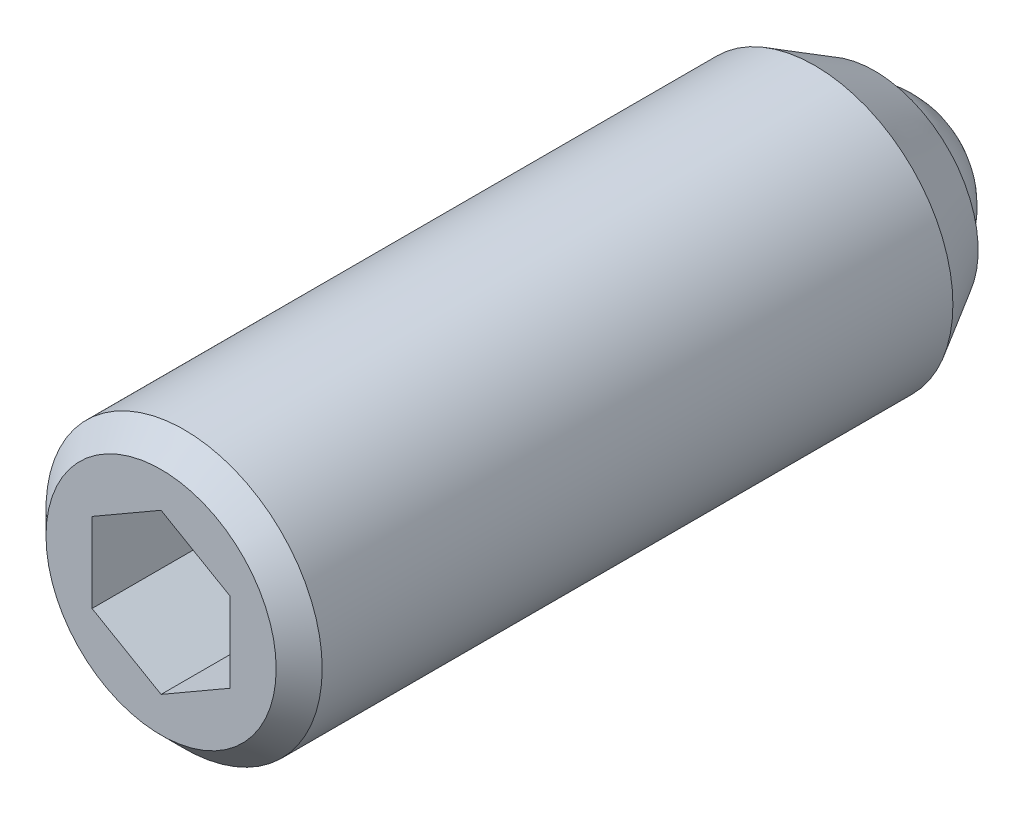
ISO-10303-21;
HEADER;
FILE_DESCRIPTION(('STEP AP214'),'2;1');
FILE_NAME('part.step','',(''),(''),'','','');
FILE_SCHEMA(('AUTOMOTIVE_DESIGN { 1 0 10303 214 1 1 1 1 }'));
ENDSEC;
DATA;
#1=APPLICATION_CONTEXT('core data for automotive mechanical design processes');
#2=APPLICATION_PROTOCOL_DEFINITION('international standard','automotive_design',2000,#1);
#3=PRODUCT_CONTEXT('',#1,'mechanical');
#4=PRODUCT('Part','Part','',(#3));
#5=PRODUCT_RELATED_PRODUCT_CATEGORY('part','',(#4));
#6=PRODUCT_DEFINITION_FORMATION('','',#4);
#7=PRODUCT_DEFINITION_CONTEXT('part definition',#1,'design');
#8=PRODUCT_DEFINITION('design','',#6,#7);
#9=PRODUCT_DEFINITION_SHAPE('','',#8);
#10=(LENGTH_UNIT() NAMED_UNIT(*) SI_UNIT(.MILLI.,.METRE.));
#11=(NAMED_UNIT(*) PLANE_ANGLE_UNIT() SI_UNIT($,.RADIAN.));
#12=(NAMED_UNIT(*) SI_UNIT($,.STERADIAN.) SOLID_ANGLE_UNIT());
#13=UNCERTAINTY_MEASURE_WITH_UNIT(LENGTH_MEASURE(1.E-05),#10,'distance_accuracy_value','');
#14=(GEOMETRIC_REPRESENTATION_CONTEXT(3) GLOBAL_UNCERTAINTY_ASSIGNED_CONTEXT((#13)) GLOBAL_UNIT_ASSIGNED_CONTEXT((#10,
#11,#12)) REPRESENTATION_CONTEXT('',''));
#15=CARTESIAN_POINT('',(0.,0.,0.));
#16=DIRECTION('',(0.,0.,1.));
#17=DIRECTION('',(1.,0.,0.));
#18=AXIS2_PLACEMENT_3D('',#15,#16,#17);
#19=CARTESIAN_POINT('',(1.5,0.866025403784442,14.4));
#20=DIRECTION('',(0.5,0.86602540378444,0.));
#21=DIRECTION('',(0.86602540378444,-0.5,0.));
#22=AXIS2_PLACEMENT_3D('',#19,#20,#21);
#23=PLANE('',#22);
#24=DIRECTION('',(0.,0.,1.));
#25=VECTOR('',#24,1.);
#26=CARTESIAN_POINT('',(1.5,0.866025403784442,14.4));
#27=LINE('',#26,#25);
#28=CARTESIAN_POINT('',(1.5,0.866025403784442,13.9));
#29=VERTEX_POINT('',#28);
#30=CARTESIAN_POINT('',(1.5,0.866025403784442,16.9));
#31=VERTEX_POINT('',#30);
#32=EDGE_CURVE('E68',#29,#31,#27,.T.);
#33=ORIENTED_EDGE('',*,*,#32,.T.);
#34=DIRECTION('',(-0.86602540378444,0.5,0.));
#35=VECTOR('',#34,1.);
#36=CARTESIAN_POINT('',(1.5,0.866025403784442,16.9));
#37=LINE('',#36,#35);
#38=CARTESIAN_POINT('',(0.,1.73205080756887,16.9));
#39=VERTEX_POINT('',#38);
#40=EDGE_CURVE('E29',#31,#39,#37,.T.);
#41=ORIENTED_EDGE('',*,*,#40,.T.);
#42=DIRECTION('',(0.,0.,1.));
#43=VECTOR('',#42,1.);
#44=CARTESIAN_POINT('',(0.,1.73205080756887,14.4));
#45=LINE('',#44,#43);
#46=CARTESIAN_POINT('',(0.,1.73205080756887,13.9));
#47=VERTEX_POINT('',#46);
#48=EDGE_CURVE('E80',#47,#39,#45,.T.);
#49=ORIENTED_EDGE('',*,*,#48,.F.);
#50=DIRECTION('',(-0.86602540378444,0.5,0.));
#51=VECTOR('',#50,1.);
#52=CARTESIAN_POINT('',(1.5,0.866025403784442,13.9));
#53=LINE('',#52,#51);
#54=EDGE_CURVE('E79',#29,#47,#53,.T.);
#55=ORIENTED_EDGE('',*,*,#54,.F.);
#56=EDGE_LOOP('',(#33,#41,#49,#55));
#57=FACE_BOUND('',#56,.T.);
#58=ADVANCED_FACE('F14',(#57),#23,.F.);
#59=CARTESIAN_POINT('',(1.5,-0.866025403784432,14.4));
#60=DIRECTION('',(1.,0.,0.));
#61=DIRECTION('',(0.,-1.,0.));
#62=AXIS2_PLACEMENT_3D('',#59,#60,#61);
#63=PLANE('',#62);
#64=DIRECTION('',(0.,0.,1.));
#65=VECTOR('',#64,1.);
#66=CARTESIAN_POINT('',(1.5,-0.866025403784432,14.4));
#67=LINE('',#66,#65);
#68=CARTESIAN_POINT('',(1.5,-0.866025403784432,13.9));
#69=VERTEX_POINT('',#68);
#70=CARTESIAN_POINT('',(1.5,-0.866025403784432,16.9));
#71=VERTEX_POINT('',#70);
#72=EDGE_CURVE('E76',#69,#71,#67,.T.);
#73=ORIENTED_EDGE('',*,*,#72,.T.);
#74=DIRECTION('',(0.,1.,0.));
#75=VECTOR('',#74,1.);
#76=CARTESIAN_POINT('',(1.5,-0.866025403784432,16.9));
#77=LINE('',#76,#75);
#78=EDGE_CURVE('E75',#71,#31,#77,.T.);
#79=ORIENTED_EDGE('',*,*,#78,.T.);
#80=ORIENTED_EDGE('',*,*,#32,.F.);
#81=DIRECTION('',(0.,1.,0.));
#82=VECTOR('',#81,1.);
#83=CARTESIAN_POINT('',(1.5,-0.866025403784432,13.9));
#84=LINE('',#83,#82);
#85=EDGE_CURVE('E72',#69,#29,#84,.T.);
#86=ORIENTED_EDGE('',*,*,#85,.F.);
#87=EDGE_LOOP('',(#73,#79,#80,#86));
#88=FACE_BOUND('',#87,.T.);
#89=ADVANCED_FACE('F70',(#88),#63,.F.);
#90=CARTESIAN_POINT('',(1.5,-0.866025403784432,14.4));
#91=DIRECTION('',(-0.5,0.866025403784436,0.));
#92=DIRECTION('',(0.866025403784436,0.5,0.));
#93=AXIS2_PLACEMENT_3D('',#90,#91,#92);
#94=PLANE('',#93);
#95=DIRECTION('',(0.,0.,1.));
#96=VECTOR('',#95,1.);
#97=CARTESIAN_POINT('',(0.,-1.73205080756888,14.4));
#98=LINE('',#97,#96);
#99=CARTESIAN_POINT('',(0.,-1.73205080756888,13.9));
#100=VERTEX_POINT('',#99);
#101=CARTESIAN_POINT('',(0.,-1.73205080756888,16.9));
#102=VERTEX_POINT('',#101);
#103=EDGE_CURVE('E122',#100,#102,#98,.T.);
#104=ORIENTED_EDGE('',*,*,#103,.T.);
#105=DIRECTION('',(-0.866025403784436,-0.5,0.));
#106=VECTOR('',#105,1.);
#107=CARTESIAN_POINT('',(1.5,-0.866025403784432,16.9));
#108=LINE('',#107,#106);
#109=EDGE_CURVE('E113',#71,#102,#108,.T.);
#110=ORIENTED_EDGE('',*,*,#109,.F.);
#111=ORIENTED_EDGE('',*,*,#72,.F.);
#112=DIRECTION('',(0.866025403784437,0.5,0.));
#113=VECTOR('',#112,1.);
#114=CARTESIAN_POINT('',(0.,-1.73205080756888,13.9));
#115=LINE('',#114,#113);
#116=EDGE_CURVE('E89',#100,#69,#115,.T.);
#117=ORIENTED_EDGE('',*,*,#116,.F.);
#118=EDGE_LOOP('',(#104,#110,#111,#117));
#119=FACE_BOUND('',#118,.T.);
#120=ADVANCED_FACE('F147',(#119),#94,.T.);
#121=CARTESIAN_POINT('',(-1.5,-0.866025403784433,14.4));
#122=DIRECTION('',(-0.5,-0.866025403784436,0.));
#123=DIRECTION('',(-0.866025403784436,0.5,0.));
#124=AXIS2_PLACEMENT_3D('',#121,#122,#123);
#125=PLANE('',#124);
#126=DIRECTION('',(0.,0.,1.));
#127=VECTOR('',#126,1.);
#128=CARTESIAN_POINT('',(-1.5,-0.866025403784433,14.4));
#129=LINE('',#128,#127);
#130=CARTESIAN_POINT('',(-1.5,-0.866025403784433,13.9));
#131=VERTEX_POINT('',#130);
#132=CARTESIAN_POINT('',(-1.5,-0.866025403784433,16.9));
#133=VERTEX_POINT('',#132);
#134=EDGE_CURVE('E120',#131,#133,#129,.T.);
#135=ORIENTED_EDGE('',*,*,#134,.T.);
#136=DIRECTION('',(0.866025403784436,-0.5,0.));
#137=VECTOR('',#136,1.);
#138=CARTESIAN_POINT('',(-1.5,-0.866025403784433,16.9));
#139=LINE('',#138,#137);
#140=EDGE_CURVE('E111',#133,#102,#139,.T.);
#141=ORIENTED_EDGE('',*,*,#140,.T.);
#142=ORIENTED_EDGE('',*,*,#103,.F.);
#143=DIRECTION('',(0.866025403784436,-0.5,0.));
#144=VECTOR('',#143,1.);
#145=CARTESIAN_POINT('',(-1.5,-0.866025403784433,13.9));
#146=LINE('',#145,#144);
#147=EDGE_CURVE('E101',#131,#100,#146,.T.);
#148=ORIENTED_EDGE('',*,*,#147,.F.);
#149=EDGE_LOOP('',(#135,#141,#142,#148));
#150=FACE_BOUND('',#149,.T.);
#151=ADVANCED_FACE('F157',(#150),#125,.F.);
#152=CARTESIAN_POINT('',(-1.5,-0.866025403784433,14.4));
#153=DIRECTION('',(1.,0.,0.));
#154=DIRECTION('',(0.,-1.,0.));
#155=AXIS2_PLACEMENT_3D('',#152,#153,#154);
#156=PLANE('',#155);
#157=DIRECTION('',(0.,0.,1.));
#158=VECTOR('',#157,1.);
#159=CARTESIAN_POINT('',(-1.5,0.866025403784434,14.4));
#160=LINE('',#159,#158);
#161=CARTESIAN_POINT('',(-1.5,0.866025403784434,13.9));
#162=VERTEX_POINT('',#161);
#163=CARTESIAN_POINT('',(-1.5,0.866025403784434,16.9));
#164=VERTEX_POINT('',#163);
#165=EDGE_CURVE('E37',#162,#164,#160,.T.);
#166=ORIENTED_EDGE('',*,*,#165,.T.);
#167=DIRECTION('',(0.,1.,0.));
#168=VECTOR('',#167,1.);
#169=CARTESIAN_POINT('',(-1.5,-0.866025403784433,16.9));
#170=LINE('',#169,#168);
#171=EDGE_CURVE('E108',#133,#164,#170,.T.);
#172=ORIENTED_EDGE('',*,*,#171,.F.);
#173=ORIENTED_EDGE('',*,*,#134,.F.);
#174=DIRECTION('',(0.,-1.,0.));
#175=VECTOR('',#174,1.);
#176=CARTESIAN_POINT('',(-1.5,0.866025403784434,13.9));
#177=LINE('',#176,#175);
#178=EDGE_CURVE('E98',#162,#131,#177,.T.);
#179=ORIENTED_EDGE('',*,*,#178,.F.);
#180=EDGE_LOOP('',(#166,#172,#173,#179));
#181=FACE_BOUND('',#180,.T.);
#182=ADVANCED_FACE('F153',(#181),#156,.T.);
#183=CARTESIAN_POINT('',(-1.5,0.866025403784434,14.4));
#184=DIRECTION('',(0.5,-0.866025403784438,0.));
#185=DIRECTION('',(-0.866025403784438,-0.5,0.));
#186=AXIS2_PLACEMENT_3D('',#183,#184,#185);
#187=PLANE('',#186);
#188=ORIENTED_EDGE('',*,*,#165,.F.);
#189=DIRECTION('',(-0.866025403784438,-0.5,0.));
#190=VECTOR('',#189,1.);
#191=CARTESIAN_POINT('',(0.,1.73205080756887,13.9));
#192=LINE('',#191,#190);
#193=EDGE_CURVE('E84',#47,#162,#192,.T.);
#194=ORIENTED_EDGE('',*,*,#193,.F.);
#195=ORIENTED_EDGE('',*,*,#48,.T.);
#196=DIRECTION('',(0.866025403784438,0.5,0.));
#197=VECTOR('',#196,1.);
#198=CARTESIAN_POINT('',(-1.5,0.866025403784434,16.9));
#199=LINE('',#198,#197);
#200=EDGE_CURVE('E105',#164,#39,#199,.T.);
#201=ORIENTED_EDGE('',*,*,#200,.F.);
#202=EDGE_LOOP('',(#188,#194,#195,#201));
#203=FACE_BOUND('',#202,.T.);
#204=ADVANCED_FACE('F150',(#203),#187,.T.);
#205=CARTESIAN_POINT('',(0.,0.,16.65));
#206=DIRECTION('',(0.,0.,-1.));
#207=DIRECTION('',(1.,0.,0.));
#208=AXIS2_PLACEMENT_3D('',#205,#206,#207);
#209=CYLINDRICAL_SURFACE('',#208,3.);
#210=CARTESIAN_POINT('',(0.,0.,16.4));
#211=DIRECTION('',(0.,0.,-1.));
#212=DIRECTION('',(1.,0.,0.));
#213=AXIS2_PLACEMENT_3D('',#210,#211,#212);
#214=CIRCLE('',#213,3.);
#215=CARTESIAN_POINT('',(3.,0.,16.4));
#216=VERTEX_POINT('',#215);
#217=EDGE_CURVE('E9',#216,#216,#214,.T.);
#218=ORIENTED_EDGE('',*,*,#217,.T.);
#219=EDGE_LOOP('',(#218));
#220=FACE_BOUND('',#219,.T.);
#221=CARTESIAN_POINT('',(0.,0.,2.69903810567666));
#222=DIRECTION('',(0.,0.,-1.));
#223=DIRECTION('',(-1.,0.,0.));
#224=AXIS2_PLACEMENT_3D('',#221,#222,#223);
#225=CIRCLE('',#224,3.);
#226=CARTESIAN_POINT('',(-3.,0.,2.69903810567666));
#227=VERTEX_POINT('',#226);
#228=EDGE_CURVE('E244',#227,#227,#225,.T.);
#229=ORIENTED_EDGE('',*,*,#228,.F.);
#230=EDGE_LOOP('',(#229));
#231=FACE_BOUND('',#230,.T.);
#232=ADVANCED_FACE('F16',(#220,#231),#209,.T.);
#233=CARTESIAN_POINT('',(0.,0.,16.4));
#234=DIRECTION('',(0.,0.,-1.));
#235=DIRECTION('',(1.,0.,0.));
#236=AXIS2_PLACEMENT_3D('',#233,#234,#235);
#237=CONICAL_SURFACE('',#236,3.,0.785398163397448);
#238=CARTESIAN_POINT('',(0.,0.,16.9));
#239=DIRECTION('',(0.,0.,-1.));
#240=DIRECTION('',(1.,0.,0.));
#241=AXIS2_PLACEMENT_3D('',#238,#239,#240);
#242=CIRCLE('',#241,2.5);
#243=CARTESIAN_POINT('',(2.5,0.,16.9));
#244=VERTEX_POINT('',#243);
#245=EDGE_CURVE('E22',#244,#244,#242,.T.);
#246=ORIENTED_EDGE('',*,*,#245,.T.);
#247=EDGE_LOOP('',(#246));
#248=FACE_BOUND('',#247,.T.);
#249=ORIENTED_EDGE('',*,*,#217,.F.);
#250=EDGE_LOOP('',(#249));
#251=FACE_BOUND('',#250,.T.);
#252=ADVANCED_FACE('F127',(#248,#251),#237,.T.);
#253=CARTESIAN_POINT('',(0.,0.,16.9));
#254=DIRECTION('',(0.,0.,-1.));
#255=DIRECTION('',(1.,0.,0.));
#256=AXIS2_PLACEMENT_3D('',#253,#254,#255);
#257=PLANE('',#256);
#258=ORIENTED_EDGE('',*,*,#200,.T.);
#259=ORIENTED_EDGE('',*,*,#40,.F.);
#260=ORIENTED_EDGE('',*,*,#78,.F.);
#261=ORIENTED_EDGE('',*,*,#109,.T.);
#262=ORIENTED_EDGE('',*,*,#140,.F.);
#263=ORIENTED_EDGE('',*,*,#171,.T.);
#264=EDGE_LOOP('',(#258,#259,#260,#261,#262,#263));
#265=FACE_BOUND('',#264,.T.);
#266=ORIENTED_EDGE('',*,*,#245,.F.);
#267=EDGE_LOOP('',(#266));
#268=FACE_BOUND('',#267,.T.);
#269=ADVANCED_FACE('F130',(#265,#268),#257,.F.);
#270=CARTESIAN_POINT('',(1.5,0.866025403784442,13.9));
#271=DIRECTION('',(0.,0.,1.));
#272=DIRECTION('',(1.,0.,0.));
#273=AXIS2_PLACEMENT_3D('',#270,#271,#272);
#274=PLANE('',#273);
#275=ORIENTED_EDGE('',*,*,#85,.T.);
#276=ORIENTED_EDGE('',*,*,#54,.T.);
#277=ORIENTED_EDGE('',*,*,#193,.T.);
#278=ORIENTED_EDGE('',*,*,#178,.T.);
#279=ORIENTED_EDGE('',*,*,#147,.T.);
#280=ORIENTED_EDGE('',*,*,#116,.T.);
#281=EDGE_LOOP('',(#275,#276,#277,#278,#279,#280));
#282=FACE_BOUND('',#281,.T.);
#283=ADVANCED_FACE('F86',(#282),#274,.T.);
#284=CARTESIAN_POINT('',(0.,0.,2.));
#285=DIRECTION('',(0.,0.,-1.));
#286=DIRECTION('',(-1.,0.,0.));
#287=AXIS2_PLACEMENT_3D('',#284,#285,#286);
#288=SPHERICAL_SURFACE('',#287,2.);
#289=CARTESIAN_POINT('',(0.,0.,1.4));
#290=DIRECTION('',(0.,0.,-1.));
#291=DIRECTION('',(-1.,0.,0.));
#292=AXIS2_PLACEMENT_3D('',#289,#290,#291);
#293=CIRCLE('',#292,1.90787840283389);
#294=CARTESIAN_POINT('',(-1.90787840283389,0.,1.4));
#295=VERTEX_POINT('',#294);
#296=EDGE_CURVE('E90',#295,#295,#293,.T.);
#297=ORIENTED_EDGE('',*,*,#296,.T.);
#298=EDGE_LOOP('',(#297));
#299=FACE_BOUND('',#298,.T.);
#300=ADVANCED_FACE('F139',(#299),#288,.T.);
#301=CARTESIAN_POINT('',(-1.90787840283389,0.,1.4));
#302=DIRECTION('',(0.,0.,-1.));
#303=DIRECTION('',(-1.,0.,0.));
#304=AXIS2_PLACEMENT_3D('',#301,#302,#303);
#305=PLANE('',#304);
#306=CARTESIAN_POINT('',(0.,0.,1.4));
#307=DIRECTION('',(0.,0.,-1.));
#308=DIRECTION('',(-1.,0.,0.));
#309=AXIS2_PLACEMENT_3D('',#306,#307,#308);
#310=CIRCLE('',#309,2.25);
#311=CARTESIAN_POINT('',(-2.25,0.,1.4));
#312=VERTEX_POINT('',#311);
#313=EDGE_CURVE('E93',#312,#312,#310,.T.);
#314=ORIENTED_EDGE('',*,*,#313,.T.);
#315=EDGE_LOOP('',(#314));
#316=FACE_BOUND('',#315,.T.);
#317=ORIENTED_EDGE('',*,*,#296,.F.);
#318=EDGE_LOOP('',(#317));
#319=FACE_BOUND('',#318,.T.);
#320=ADVANCED_FACE('F216',(#316,#319),#305,.T.);
#321=CARTESIAN_POINT('',(0.,0.,1.4));
#322=DIRECTION('',(0.,0.,1.));
#323=DIRECTION('',(1.,0.,0.));
#324=AXIS2_PLACEMENT_3D('',#321,#322,#323);
#325=CONICAL_SURFACE('',#324,2.25,0.523598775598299);
#326=ORIENTED_EDGE('',*,*,#228,.T.);
#327=EDGE_LOOP('',(#326));
#328=FACE_BOUND('',#327,.T.);
#329=ORIENTED_EDGE('',*,*,#313,.F.);
#330=EDGE_LOOP('',(#329));
#331=FACE_BOUND('',#330,.T.);
#332=ADVANCED_FACE('F225',(#328,#331),#325,.T.);
#333=CLOSED_SHELL('',(#58,#89,#120,#151,#182,#204,#232,#252,#269,#283,#300,#320,#332));
#334=MANIFOLD_SOLID_BREP('B1',#333);
#335=ADVANCED_BREP_SHAPE_REPRESENTATION('',(#18,#334),#14);
#336=SHAPE_DEFINITION_REPRESENTATION(#9,#335);
ENDSEC;
END-ISO-10303-21;
